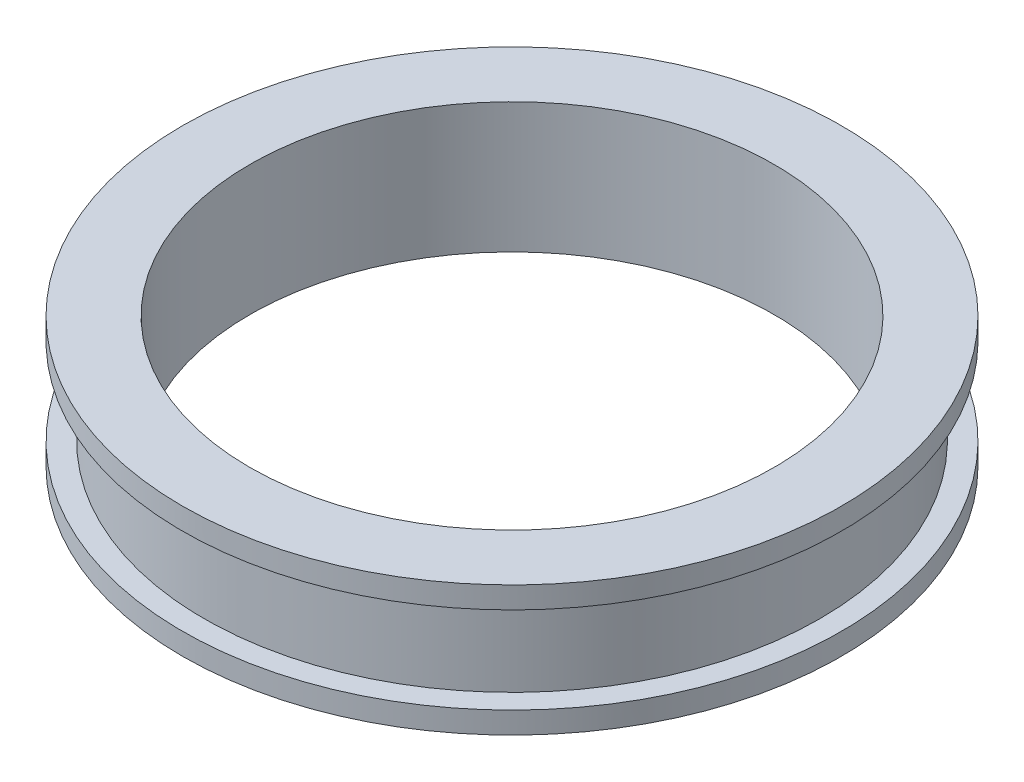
from build123d import *

# Parameters (mm, degrees)
SKETCH1_R          = 76
EXTRUDE1_DEPTH     = 30
SKETCH2_R          = 60.5
CUT_EXTRUDE1_DEPTH = 112.588529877
SKETCH3_W          = 5
SKETCH3_H          = 20


with BuildPart() as part:
    # Sketch1 → Extrude1 (new body)
    with BuildSketch(Plane(origin=(0, 0, 0), x_dir=(1, 0, 0), z_dir=(0, 1, 0))):
        with Locations(Location((0, 0, 0), (0, 0, 270))):
            Circle(SKETCH1_R)
    extrude(amount=EXTRUDE1_DEPTH)

    # Sketch2 → Cut-Extrude1 (cut, through all)
    with BuildSketch(Plane(origin=(0, 30, 0), x_dir=(-1, 0, 0), z_dir=(0, 1, 0))):
        with Locations(Location((0, 0, 0), (0, 0, 90))):
            Circle(SKETCH2_R)
    extrude(amount=-CUT_EXTRUDE1_DEPTH, mode=Mode.SUBTRACT)

    # Sketch3 → Cut-Revolve1 (revolve, cut)
    with BuildSketch(Plane.XY):
        with Locations((-73.5, 15)):
            Rectangle(SKETCH3_W, SKETCH3_H)
    revolve(axis=Axis((0, 69.961359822, 0), (0, -1, 0)), mode=Mode.SUBTRACT)


solid = part.part
